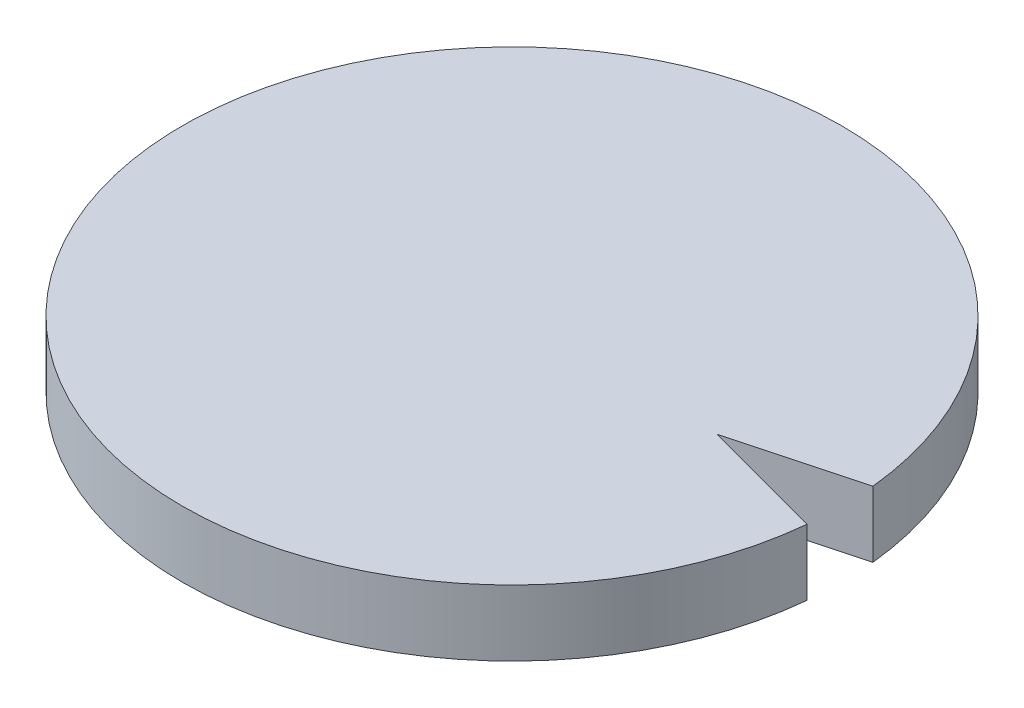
from build123d import *

# Parameters (mm, degrees)
EXTRUDE1_DEPTH = 5


with BuildPart() as part:
    # Sketch1 → Extrude1 (new, symmetric)
    with BuildSketch(Plane(origin=(0, 0, 0), x_dir=(1, 0, 0), z_dir=(0, 1, 0))):
        with BuildLine():
            Line((31.089117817, 0), (49.749371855, 5))
            ThreePointArc((49.749371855, 5), (-50, 0), (49.749371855, -5))
            Line((49.749371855, -5), (31.089117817, 0))
        make_face()
    extrude(amount=EXTRUDE1_DEPTH, both=True)


solid = part.part
